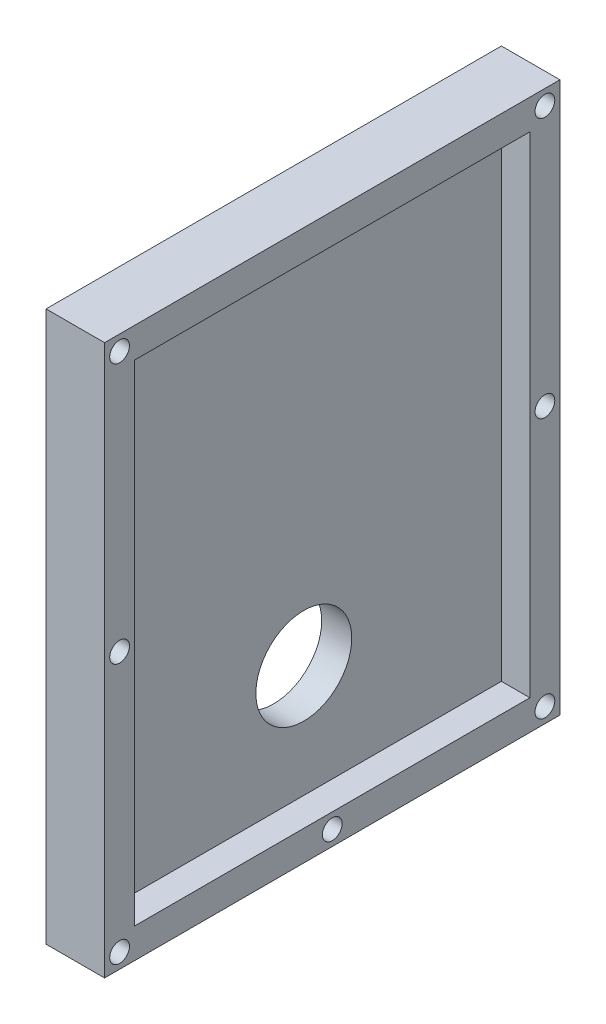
ISO-10303-21;
HEADER;
FILE_DESCRIPTION(('STEP AP214'),'2;1');
FILE_NAME('part.step','',(''),(''),'','','');
FILE_SCHEMA(('AUTOMOTIVE_DESIGN { 1 0 10303 214 1 1 1 1 }'));
ENDSEC;
DATA;
#1=APPLICATION_CONTEXT('core data for automotive mechanical design processes');
#2=APPLICATION_PROTOCOL_DEFINITION('international standard','automotive_design',2000,#1);
#3=PRODUCT_CONTEXT('',#1,'mechanical');
#4=PRODUCT('Part','Part','',(#3));
#5=PRODUCT_RELATED_PRODUCT_CATEGORY('part','',(#4));
#6=PRODUCT_DEFINITION_FORMATION('','',#4);
#7=PRODUCT_DEFINITION_CONTEXT('part definition',#1,'design');
#8=PRODUCT_DEFINITION('design','',#6,#7);
#9=PRODUCT_DEFINITION_SHAPE('','',#8);
#10=(LENGTH_UNIT() NAMED_UNIT(*) SI_UNIT(.MILLI.,.METRE.));
#11=(NAMED_UNIT(*) PLANE_ANGLE_UNIT() SI_UNIT($,.RADIAN.));
#12=(NAMED_UNIT(*) SI_UNIT($,.STERADIAN.) SOLID_ANGLE_UNIT());
#13=UNCERTAINTY_MEASURE_WITH_UNIT(LENGTH_MEASURE(1.E-05),#10,'distance_accuracy_value','');
#14=(GEOMETRIC_REPRESENTATION_CONTEXT(3) GLOBAL_UNCERTAINTY_ASSIGNED_CONTEXT((#13)) GLOBAL_UNIT_ASSIGNED_CONTEXT((#10,
#11,#12)) REPRESENTATION_CONTEXT('',''));
#15=CARTESIAN_POINT('',(0.,0.,0.));
#16=DIRECTION('',(0.,0.,1.));
#17=DIRECTION('',(1.,0.,0.));
#18=AXIS2_PLACEMENT_3D('',#15,#16,#17);
#19=CARTESIAN_POINT('',(2.286,0.,0.));
#20=DIRECTION('',(-1.,0.,0.));
#21=DIRECTION('',(0.,0.,1.));
#22=AXIS2_PLACEMENT_3D('',#19,#20,#21);
#23=PLANE('',#22);
#24=CARTESIAN_POINT('',(2.286,19.685,32.9565));
#25=DIRECTION('',(1.,0.,0.));
#26=DIRECTION('',(0.,0.,-1.));
#27=AXIS2_PLACEMENT_3D('',#24,#25,#26);
#28=CIRCLE('',#27,0.793749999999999);
#29=CARTESIAN_POINT('',(2.286,19.685,32.16275));
#30=VERTEX_POINT('',#29);
#31=EDGE_CURVE('E343',#30,#30,#28,.T.);
#32=ORIENTED_EDGE('',*,*,#31,.F.);
#33=EDGE_LOOP('',(#32));
#34=FACE_BOUND('',#33,.T.);
#35=CARTESIAN_POINT('',(2.286,40.5765,32.9565));
#36=DIRECTION('',(1.,0.,0.));
#37=DIRECTION('',(0.,0.,-1.));
#38=AXIS2_PLACEMENT_3D('',#35,#36,#37);
#39=CIRCLE('',#38,0.793749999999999);
#40=CARTESIAN_POINT('',(2.286,40.5765,32.16275));
#41=VERTEX_POINT('',#40);
#42=EDGE_CURVE('E349',#41,#41,#39,.T.);
#43=ORIENTED_EDGE('',*,*,#42,.F.);
#44=EDGE_LOOP('',(#43));
#45=FACE_BOUND('',#44,.T.);
#46=CARTESIAN_POINT('',(2.286,-1.2065,15.875));
#47=DIRECTION('',(1.,0.,0.));
#48=DIRECTION('',(0.,0.,-1.));
#49=AXIS2_PLACEMENT_3D('',#46,#47,#48);
#50=CIRCLE('',#49,0.793749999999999);
#51=CARTESIAN_POINT('',(2.286,-1.2065,15.08125));
#52=VERTEX_POINT('',#51);
#53=EDGE_CURVE('E360',#52,#52,#50,.T.);
#54=ORIENTED_EDGE('',*,*,#53,.F.);
#55=EDGE_LOOP('',(#54));
#56=FACE_BOUND('',#55,.T.);
#57=CARTESIAN_POINT('',(2.286,40.5765,-1.2065));
#58=DIRECTION('',(1.,0.,0.));
#59=DIRECTION('',(0.,0.,-1.));
#60=AXIS2_PLACEMENT_3D('',#57,#58,#59);
#61=CIRCLE('',#60,0.79375);
#62=CARTESIAN_POINT('',(2.286,40.5765,-2.00025));
#63=VERTEX_POINT('',#62);
#64=EDGE_CURVE('E366',#63,#63,#61,.T.);
#65=ORIENTED_EDGE('',*,*,#64,.F.);
#66=EDGE_LOOP('',(#65));
#67=FACE_BOUND('',#66,.T.);
#68=CARTESIAN_POINT('',(2.286,19.685,-1.2065));
#69=DIRECTION('',(1.,0.,0.));
#70=DIRECTION('',(0.,0.,-1.));
#71=AXIS2_PLACEMENT_3D('',#68,#69,#70);
#72=CIRCLE('',#71,0.79375);
#73=CARTESIAN_POINT('',(2.286,19.685,-2.00025));
#74=VERTEX_POINT('',#73);
#75=EDGE_CURVE('E372',#74,#74,#72,.T.);
#76=ORIENTED_EDGE('',*,*,#75,.F.);
#77=EDGE_LOOP('',(#76));
#78=FACE_BOUND('',#77,.T.);
#79=CARTESIAN_POINT('',(2.286,-1.2065,-1.2065));
#80=DIRECTION('',(1.,0.,0.));
#81=DIRECTION('',(0.,0.,-1.));
#82=AXIS2_PLACEMENT_3D('',#79,#80,#81);
#83=CIRCLE('',#82,0.79375);
#84=CARTESIAN_POINT('',(2.286,-1.2065,-2.00025));
#85=VERTEX_POINT('',#84);
#86=EDGE_CURVE('E397',#85,#85,#83,.T.);
#87=ORIENTED_EDGE('',*,*,#86,.F.);
#88=EDGE_LOOP('',(#87));
#89=FACE_BOUND('',#88,.T.);
#90=CARTESIAN_POINT('',(2.286,-1.2065,32.9565));
#91=DIRECTION('',(1.,0.,0.));
#92=DIRECTION('',(0.,0.,-1.));
#93=AXIS2_PLACEMENT_3D('',#90,#91,#92);
#94=CIRCLE('',#93,0.79375);
#95=CARTESIAN_POINT('',(2.286,-1.2065,32.16275));
#96=VERTEX_POINT('',#95);
#97=EDGE_CURVE('E344',#96,#96,#94,.T.);
#98=ORIENTED_EDGE('',*,*,#97,.F.);
#99=EDGE_LOOP('',(#98));
#100=FACE_BOUND('',#99,.T.);
#101=DIRECTION('',(0.,0.,-1.));
#102=VECTOR('',#101,1.);
#103=CARTESIAN_POINT('',(2.286,-2.413,0.));
#104=LINE('',#103,#102);
#105=CARTESIAN_POINT('',(2.286,-2.41300000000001,34.163));
#106=VERTEX_POINT('',#105);
#107=CARTESIAN_POINT('',(2.286,-2.413,-2.413));
#108=VERTEX_POINT('',#107);
#109=EDGE_CURVE('E168',#106,#108,#104,.T.);
#110=ORIENTED_EDGE('',*,*,#109,.T.);
#111=DIRECTION('',(0.,1.,0.));
#112=VECTOR('',#111,1.);
#113=CARTESIAN_POINT('',(2.286,0.,-2.413));
#114=LINE('',#113,#112);
#115=CARTESIAN_POINT('',(2.286,41.783,-2.413));
#116=VERTEX_POINT('',#115);
#117=EDGE_CURVE('E170',#108,#116,#114,.T.);
#118=ORIENTED_EDGE('',*,*,#117,.T.);
#119=DIRECTION('',(0.,0.,1.));
#120=VECTOR('',#119,1.);
#121=CARTESIAN_POINT('',(2.286,41.783,0.));
#122=LINE('',#121,#120);
#123=CARTESIAN_POINT('',(2.286,41.783,34.163));
#124=VERTEX_POINT('',#123);
#125=EDGE_CURVE('E171',#116,#124,#122,.T.);
#126=ORIENTED_EDGE('',*,*,#125,.T.);
#127=DIRECTION('',(0.,-1.,0.));
#128=VECTOR('',#127,1.);
#129=CARTESIAN_POINT('',(2.286,0.,34.163));
#130=LINE('',#129,#128);
#131=EDGE_CURVE('E47',#124,#106,#130,.T.);
#132=ORIENTED_EDGE('',*,*,#131,.T.);
#133=EDGE_LOOP('',(#110,#118,#126,#132));
#134=FACE_BOUND('',#133,.T.);
#135=DIRECTION('',(0.,0.,-1.));
#136=VECTOR('',#135,1.);
#137=CARTESIAN_POINT('',(2.286,0.,0.));
#138=LINE('',#137,#136);
#139=CARTESIAN_POINT('',(2.286,0.,31.75));
#140=VERTEX_POINT('',#139);
#141=CARTESIAN_POINT('',(2.286,0.,0.));
#142=VERTEX_POINT('',#141);
#143=EDGE_CURVE('E112',#140,#142,#138,.T.);
#144=ORIENTED_EDGE('',*,*,#143,.F.);
#145=DIRECTION('',(0.,-1.,0.));
#146=VECTOR('',#145,1.);
#147=CARTESIAN_POINT('',(2.286,0.,31.75));
#148=LINE('',#147,#146);
#149=CARTESIAN_POINT('',(2.286,39.37,31.75));
#150=VERTEX_POINT('',#149);
#151=EDGE_CURVE('E137',#150,#140,#148,.T.);
#152=ORIENTED_EDGE('',*,*,#151,.F.);
#153=DIRECTION('',(0.,0.,1.));
#154=VECTOR('',#153,1.);
#155=CARTESIAN_POINT('',(2.286,39.37,0.));
#156=LINE('',#155,#154);
#157=CARTESIAN_POINT('',(2.286,39.37,0.));
#158=VERTEX_POINT('',#157);
#159=EDGE_CURVE('E135',#158,#150,#156,.T.);
#160=ORIENTED_EDGE('',*,*,#159,.F.);
#161=DIRECTION('',(0.,1.,0.));
#162=VECTOR('',#161,1.);
#163=CARTESIAN_POINT('',(2.286,0.,0.));
#164=LINE('',#163,#162);
#165=EDGE_CURVE('E123',#142,#158,#164,.T.);
#166=ORIENTED_EDGE('',*,*,#165,.F.);
#167=EDGE_LOOP('',(#144,#152,#160,#166));
#168=FACE_BOUND('',#167,.T.);
#169=ADVANCED_FACE('F43',(#34,#45,#56,#67,#78,#89,#100,#134,#168),#23,.F.);
#170=CARTESIAN_POINT('',(2.286,-2.413,0.));
#171=DIRECTION('',(0.,1.,0.));
#172=DIRECTION('',(0.,0.,1.));
#173=AXIS2_PLACEMENT_3D('',#170,#171,#172);
#174=PLANE('',#173);
#175=DIRECTION('',(0.,0.,-1.));
#176=VECTOR('',#175,1.);
#177=CARTESIAN_POINT('',(-2.413,-2.413,0.));
#178=LINE('',#177,#176);
#179=CARTESIAN_POINT('',(-2.413,-2.41300000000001,34.163));
#180=VERTEX_POINT('',#179);
#181=CARTESIAN_POINT('',(-2.413,-2.413,-2.413));
#182=VERTEX_POINT('',#181);
#183=EDGE_CURVE('E131',#180,#182,#178,.T.);
#184=ORIENTED_EDGE('',*,*,#183,.T.);
#185=DIRECTION('',(-1.,0.,0.));
#186=VECTOR('',#185,1.);
#187=CARTESIAN_POINT('',(2.286,-2.413,-2.413));
#188=LINE('',#187,#186);
#189=EDGE_CURVE('E11',#108,#182,#188,.T.);
#190=ORIENTED_EDGE('',*,*,#189,.F.);
#191=ORIENTED_EDGE('',*,*,#109,.F.);
#192=DIRECTION('',(-1.,0.,0.));
#193=VECTOR('',#192,1.);
#194=CARTESIAN_POINT('',(2.286,-2.41300000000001,34.163));
#195=LINE('',#194,#193);
#196=EDGE_CURVE('E155',#106,#180,#195,.T.);
#197=ORIENTED_EDGE('',*,*,#196,.T.);
#198=EDGE_LOOP('',(#184,#190,#191,#197));
#199=FACE_BOUND('',#198,.T.);
#200=ADVANCED_FACE('F185',(#199),#174,.F.);
#201=CARTESIAN_POINT('',(2.286,0.,-2.413));
#202=DIRECTION('',(0.,0.,1.));
#203=DIRECTION('',(1.,0.,0.));
#204=AXIS2_PLACEMENT_3D('',#201,#202,#203);
#205=PLANE('',#204);
#206=DIRECTION('',(0.,1.,0.));
#207=VECTOR('',#206,1.);
#208=CARTESIAN_POINT('',(-2.413,0.,-2.413));
#209=LINE('',#208,#207);
#210=CARTESIAN_POINT('',(-2.413,41.783,-2.413));
#211=VERTEX_POINT('',#210);
#212=EDGE_CURVE('E153',#182,#211,#209,.T.);
#213=ORIENTED_EDGE('',*,*,#212,.T.);
#214=DIRECTION('',(-1.,0.,0.));
#215=VECTOR('',#214,1.);
#216=CARTESIAN_POINT('',(2.286,41.783,-2.413));
#217=LINE('',#216,#215);
#218=EDGE_CURVE('E52',#116,#211,#217,.T.);
#219=ORIENTED_EDGE('',*,*,#218,.F.);
#220=ORIENTED_EDGE('',*,*,#117,.F.);
#221=ORIENTED_EDGE('',*,*,#189,.T.);
#222=EDGE_LOOP('',(#213,#219,#220,#221));
#223=FACE_BOUND('',#222,.T.);
#224=ADVANCED_FACE('F187',(#223),#205,.F.);
#225=CARTESIAN_POINT('',(2.286,41.783,0.));
#226=DIRECTION('',(0.,-1.,0.));
#227=DIRECTION('',(0.,0.,-1.));
#228=AXIS2_PLACEMENT_3D('',#225,#226,#227);
#229=PLANE('',#228);
#230=DIRECTION('',(0.,0.,1.));
#231=VECTOR('',#230,1.);
#232=CARTESIAN_POINT('',(-2.413,41.783,0.));
#233=LINE('',#232,#231);
#234=CARTESIAN_POINT('',(-2.413,41.783,34.163));
#235=VERTEX_POINT('',#234);
#236=EDGE_CURVE('E160',#211,#235,#233,.T.);
#237=ORIENTED_EDGE('',*,*,#236,.T.);
#238=DIRECTION('',(-1.,0.,0.));
#239=VECTOR('',#238,1.);
#240=CARTESIAN_POINT('',(2.286,41.783,34.163));
#241=LINE('',#240,#239);
#242=EDGE_CURVE('E158',#124,#235,#241,.T.);
#243=ORIENTED_EDGE('',*,*,#242,.F.);
#244=ORIENTED_EDGE('',*,*,#125,.F.);
#245=ORIENTED_EDGE('',*,*,#218,.T.);
#246=EDGE_LOOP('',(#237,#243,#244,#245));
#247=FACE_BOUND('',#246,.T.);
#248=ADVANCED_FACE('F176',(#247),#229,.F.);
#249=CARTESIAN_POINT('',(2.286,0.,34.163));
#250=DIRECTION('',(0.,0.,-1.));
#251=DIRECTION('',(-1.,0.,0.));
#252=AXIS2_PLACEMENT_3D('',#249,#250,#251);
#253=PLANE('',#252);
#254=DIRECTION('',(0.,-1.,0.));
#255=VECTOR('',#254,1.);
#256=CARTESIAN_POINT('',(-2.413,0.,34.163));
#257=LINE('',#256,#255);
#258=EDGE_CURVE('E164',#235,#180,#257,.T.);
#259=ORIENTED_EDGE('',*,*,#258,.T.);
#260=ORIENTED_EDGE('',*,*,#196,.F.);
#261=ORIENTED_EDGE('',*,*,#131,.F.);
#262=ORIENTED_EDGE('',*,*,#242,.T.);
#263=EDGE_LOOP('',(#259,#260,#261,#262));
#264=FACE_BOUND('',#263,.T.);
#265=ADVANCED_FACE('F180',(#264),#253,.F.);
#266=CARTESIAN_POINT('',(-2.413,0.,0.));
#267=DIRECTION('',(-1.,0.,0.));
#268=DIRECTION('',(0.,0.,1.));
#269=AXIS2_PLACEMENT_3D('',#266,#267,#268);
#270=PLANE('',#269);
#271=CARTESIAN_POINT('',(-2.413,19.685,32.9565));
#272=DIRECTION('',(1.,0.,0.));
#273=DIRECTION('',(0.,0.,-1.));
#274=AXIS2_PLACEMENT_3D('',#271,#272,#273);
#275=CIRCLE('',#274,0.793749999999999);
#276=CARTESIAN_POINT('',(-2.413,19.685,32.16275));
#277=VERTEX_POINT('',#276);
#278=EDGE_CURVE('E341',#277,#277,#275,.T.);
#279=ORIENTED_EDGE('',*,*,#278,.T.);
#280=EDGE_LOOP('',(#279));
#281=FACE_BOUND('',#280,.T.);
#282=CARTESIAN_POINT('',(-2.413,40.5765,32.9565));
#283=DIRECTION('',(1.,0.,0.));
#284=DIRECTION('',(0.,0.,-1.));
#285=AXIS2_PLACEMENT_3D('',#282,#283,#284);
#286=CIRCLE('',#285,0.793749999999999);
#287=CARTESIAN_POINT('',(-2.413,40.5765,32.16275));
#288=VERTEX_POINT('',#287);
#289=EDGE_CURVE('E357',#288,#288,#286,.T.);
#290=ORIENTED_EDGE('',*,*,#289,.T.);
#291=EDGE_LOOP('',(#290));
#292=FACE_BOUND('',#291,.T.);
#293=CARTESIAN_POINT('',(-2.413,-1.2065,15.875));
#294=DIRECTION('',(1.,0.,0.));
#295=DIRECTION('',(0.,0.,-1.));
#296=AXIS2_PLACEMENT_3D('',#293,#294,#295);
#297=CIRCLE('',#296,0.793749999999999);
#298=CARTESIAN_POINT('',(-2.413,-1.2065,15.08125));
#299=VERTEX_POINT('',#298);
#300=EDGE_CURVE('E363',#299,#299,#297,.T.);
#301=ORIENTED_EDGE('',*,*,#300,.T.);
#302=EDGE_LOOP('',(#301));
#303=FACE_BOUND('',#302,.T.);
#304=CARTESIAN_POINT('',(-2.413,40.5765,-1.2065));
#305=DIRECTION('',(1.,0.,0.));
#306=DIRECTION('',(0.,0.,-1.));
#307=AXIS2_PLACEMENT_3D('',#304,#305,#306);
#308=CIRCLE('',#307,0.79375);
#309=CARTESIAN_POINT('',(-2.413,40.5765,-2.00025));
#310=VERTEX_POINT('',#309);
#311=EDGE_CURVE('E369',#310,#310,#308,.T.);
#312=ORIENTED_EDGE('',*,*,#311,.T.);
#313=EDGE_LOOP('',(#312));
#314=FACE_BOUND('',#313,.T.);
#315=CARTESIAN_POINT('',(-2.413,19.685,-1.2065));
#316=DIRECTION('',(1.,0.,0.));
#317=DIRECTION('',(0.,0.,-1.));
#318=AXIS2_PLACEMENT_3D('',#315,#316,#317);
#319=CIRCLE('',#318,0.79375);
#320=CARTESIAN_POINT('',(-2.413,19.685,-2.00025));
#321=VERTEX_POINT('',#320);
#322=EDGE_CURVE('E392',#321,#321,#319,.T.);
#323=ORIENTED_EDGE('',*,*,#322,.T.);
#324=EDGE_LOOP('',(#323));
#325=FACE_BOUND('',#324,.T.);
#326=CARTESIAN_POINT('',(-2.413,-1.2065,-1.2065));
#327=DIRECTION('',(1.,0.,0.));
#328=DIRECTION('',(0.,0.,-1.));
#329=AXIS2_PLACEMENT_3D('',#326,#327,#328);
#330=CIRCLE('',#329,0.79375);
#331=CARTESIAN_POINT('',(-2.413,-1.2065,-2.00025));
#332=VERTEX_POINT('',#331);
#333=EDGE_CURVE('E352',#332,#332,#330,.T.);
#334=ORIENTED_EDGE('',*,*,#333,.T.);
#335=EDGE_LOOP('',(#334));
#336=FACE_BOUND('',#335,.T.);
#337=CARTESIAN_POINT('',(-2.413,-1.2065,32.9565));
#338=DIRECTION('',(1.,0.,0.));
#339=DIRECTION('',(0.,0.,-1.));
#340=AXIS2_PLACEMENT_3D('',#337,#338,#339);
#341=CIRCLE('',#340,0.79375);
#342=CARTESIAN_POINT('',(-2.413,-1.2065,32.16275));
#343=VERTEX_POINT('',#342);
#344=EDGE_CURVE('E347',#343,#343,#341,.T.);
#345=ORIENTED_EDGE('',*,*,#344,.T.);
#346=EDGE_LOOP('',(#345));
#347=FACE_BOUND('',#346,.T.);
#348=CARTESIAN_POINT('',(-2.413,9.01699999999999,15.875));
#349=DIRECTION('',(1.,0.,0.));
#350=DIRECTION('',(0.,0.,-1.));
#351=AXIS2_PLACEMENT_3D('',#348,#349,#350);
#352=CIRCLE('',#351,3.85091664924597);
#353=CARTESIAN_POINT('',(-2.413,9.01699999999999,12.024083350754));
#354=VERTEX_POINT('',#353);
#355=EDGE_CURVE('E144',#354,#354,#352,.T.);
#356=ORIENTED_EDGE('',*,*,#355,.T.);
#357=EDGE_LOOP('',(#356));
#358=FACE_BOUND('',#357,.T.);
#359=ORIENTED_EDGE('',*,*,#183,.F.);
#360=ORIENTED_EDGE('',*,*,#258,.F.);
#361=ORIENTED_EDGE('',*,*,#236,.F.);
#362=ORIENTED_EDGE('',*,*,#212,.F.);
#363=EDGE_LOOP('',(#359,#360,#361,#362));
#364=FACE_BOUND('',#363,.T.);
#365=ADVANCED_FACE('F45',(#281,#292,#303,#314,#325,#336,#347,#358,#364),#270,.T.);
#366=CARTESIAN_POINT('',(2.286,0.,0.));
#367=DIRECTION('',(0.,1.,0.));
#368=DIRECTION('',(0.,0.,1.));
#369=AXIS2_PLACEMENT_3D('',#366,#367,#368);
#370=PLANE('',#369);
#371=DIRECTION('',(0.,0.,-1.));
#372=VECTOR('',#371,1.);
#373=CARTESIAN_POINT('',(0.,0.,0.));
#374=LINE('',#373,#372);
#375=CARTESIAN_POINT('',(0.,0.,31.75));
#376=VERTEX_POINT('',#375);
#377=CARTESIAN_POINT('',(0.,0.,0.));
#378=VERTEX_POINT('',#377);
#379=EDGE_CURVE('E142',#376,#378,#374,.T.);
#380=ORIENTED_EDGE('',*,*,#379,.F.);
#381=DIRECTION('',(-1.,0.,0.));
#382=VECTOR('',#381,1.);
#383=CARTESIAN_POINT('',(2.286,0.,31.75));
#384=LINE('',#383,#382);
#385=EDGE_CURVE('E119',#140,#376,#384,.T.);
#386=ORIENTED_EDGE('',*,*,#385,.F.);
#387=ORIENTED_EDGE('',*,*,#143,.T.);
#388=DIRECTION('',(-1.,0.,0.));
#389=VECTOR('',#388,1.);
#390=CARTESIAN_POINT('',(2.286,0.,0.));
#391=LINE('',#390,#389);
#392=EDGE_CURVE('E116',#142,#378,#391,.T.);
#393=ORIENTED_EDGE('',*,*,#392,.T.);
#394=EDGE_LOOP('',(#380,#386,#387,#393));
#395=FACE_BOUND('',#394,.T.);
#396=ADVANCED_FACE('F115',(#395),#370,.T.);
#397=CARTESIAN_POINT('',(2.286,0.,0.));
#398=DIRECTION('',(0.,0.,1.));
#399=DIRECTION('',(1.,0.,0.));
#400=AXIS2_PLACEMENT_3D('',#397,#398,#399);
#401=PLANE('',#400);
#402=DIRECTION('',(0.,1.,0.));
#403=VECTOR('',#402,1.);
#404=CARTESIAN_POINT('',(0.,0.,0.));
#405=LINE('',#404,#403);
#406=CARTESIAN_POINT('',(0.,39.37,0.));
#407=VERTEX_POINT('',#406);
#408=EDGE_CURVE('E130',#378,#407,#405,.T.);
#409=ORIENTED_EDGE('',*,*,#408,.F.);
#410=ORIENTED_EDGE('',*,*,#392,.F.);
#411=ORIENTED_EDGE('',*,*,#165,.T.);
#412=DIRECTION('',(-1.,0.,0.));
#413=VECTOR('',#412,1.);
#414=CARTESIAN_POINT('',(2.286,39.37,0.));
#415=LINE('',#414,#413);
#416=EDGE_CURVE('E132',#158,#407,#415,.T.);
#417=ORIENTED_EDGE('',*,*,#416,.T.);
#418=EDGE_LOOP('',(#409,#410,#411,#417));
#419=FACE_BOUND('',#418,.T.);
#420=ADVANCED_FACE('F127',(#419),#401,.T.);
#421=CARTESIAN_POINT('',(2.286,39.37,0.));
#422=DIRECTION('',(0.,-1.,0.));
#423=DIRECTION('',(0.,0.,-1.));
#424=AXIS2_PLACEMENT_3D('',#421,#422,#423);
#425=PLANE('',#424);
#426=DIRECTION('',(0.,0.,1.));
#427=VECTOR('',#426,1.);
#428=CARTESIAN_POINT('',(0.,39.37,0.));
#429=LINE('',#428,#427);
#430=CARTESIAN_POINT('',(0.,39.37,31.75));
#431=VERTEX_POINT('',#430);
#432=EDGE_CURVE('E146',#407,#431,#429,.T.);
#433=ORIENTED_EDGE('',*,*,#432,.F.);
#434=ORIENTED_EDGE('',*,*,#416,.F.);
#435=ORIENTED_EDGE('',*,*,#159,.T.);
#436=DIRECTION('',(-1.,0.,0.));
#437=VECTOR('',#436,1.);
#438=CARTESIAN_POINT('',(2.286,39.37,31.75));
#439=LINE('',#438,#437);
#440=EDGE_CURVE('E60',#150,#431,#439,.T.);
#441=ORIENTED_EDGE('',*,*,#440,.T.);
#442=EDGE_LOOP('',(#433,#434,#435,#441));
#443=FACE_BOUND('',#442,.T.);
#444=ADVANCED_FACE('F234',(#443),#425,.T.);
#445=CARTESIAN_POINT('',(2.286,0.,31.75));
#446=DIRECTION('',(0.,0.,-1.));
#447=DIRECTION('',(-1.,0.,0.));
#448=AXIS2_PLACEMENT_3D('',#445,#446,#447);
#449=PLANE('',#448);
#450=DIRECTION('',(0.,-1.,0.));
#451=VECTOR('',#450,1.);
#452=CARTESIAN_POINT('',(0.,0.,31.75));
#453=LINE('',#452,#451);
#454=EDGE_CURVE('E124',#431,#376,#453,.T.);
#455=ORIENTED_EDGE('',*,*,#454,.F.);
#456=ORIENTED_EDGE('',*,*,#440,.F.);
#457=ORIENTED_EDGE('',*,*,#151,.T.);
#458=ORIENTED_EDGE('',*,*,#385,.T.);
#459=EDGE_LOOP('',(#455,#456,#457,#458));
#460=FACE_BOUND('',#459,.T.);
#461=ADVANCED_FACE('F240',(#460),#449,.T.);
#462=CARTESIAN_POINT('',(0.,0.,0.));
#463=DIRECTION('',(-1.,0.,0.));
#464=DIRECTION('',(0.,0.,1.));
#465=AXIS2_PLACEMENT_3D('',#462,#463,#464);
#466=PLANE('',#465);
#467=CARTESIAN_POINT('',(0.,9.01699999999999,15.875));
#468=DIRECTION('',(1.,0.,0.));
#469=DIRECTION('',(0.,0.,-1.));
#470=AXIS2_PLACEMENT_3D('',#467,#468,#469);
#471=CIRCLE('',#470,3.85091664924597);
#472=CARTESIAN_POINT('',(0.,9.01699999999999,12.024083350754));
#473=VERTEX_POINT('',#472);
#474=EDGE_CURVE('E374',#473,#473,#471,.T.);
#475=ORIENTED_EDGE('',*,*,#474,.F.);
#476=EDGE_LOOP('',(#475));
#477=FACE_BOUND('',#476,.T.);
#478=ORIENTED_EDGE('',*,*,#379,.T.);
#479=ORIENTED_EDGE('',*,*,#408,.T.);
#480=ORIENTED_EDGE('',*,*,#432,.T.);
#481=ORIENTED_EDGE('',*,*,#454,.T.);
#482=EDGE_LOOP('',(#478,#479,#480,#481));
#483=FACE_BOUND('',#482,.T.);
#484=ADVANCED_FACE('F248',(#477,#483),#466,.F.);
#485=CARTESIAN_POINT('',(-2.413,9.01699999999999,15.875));
#486=DIRECTION('',(1.,0.,0.));
#487=DIRECTION('',(0.,0.,-1.));
#488=AXIS2_PLACEMENT_3D('',#485,#486,#487);
#489=CYLINDRICAL_SURFACE('',#488,3.85091664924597);
#490=ORIENTED_EDGE('',*,*,#355,.F.);
#491=EDGE_LOOP('',(#490));
#492=FACE_BOUND('',#491,.T.);
#493=ORIENTED_EDGE('',*,*,#474,.T.);
#494=EDGE_LOOP('',(#493));
#495=FACE_BOUND('',#494,.T.);
#496=ADVANCED_FACE('F254',(#492,#495),#489,.F.);
#497=CARTESIAN_POINT('',(-2.413,-1.2065,32.9565));
#498=DIRECTION('',(1.,0.,0.));
#499=DIRECTION('',(0.,0.,-1.));
#500=AXIS2_PLACEMENT_3D('',#497,#498,#499);
#501=CYLINDRICAL_SURFACE('',#500,0.79375);
#502=ORIENTED_EDGE('',*,*,#344,.F.);
#503=EDGE_LOOP('',(#502));
#504=FACE_BOUND('',#503,.T.);
#505=ORIENTED_EDGE('',*,*,#97,.T.);
#506=EDGE_LOOP('',(#505));
#507=FACE_BOUND('',#506,.T.);
#508=ADVANCED_FACE('F262',(#504,#507),#501,.F.);
#509=CARTESIAN_POINT('',(-2.413,-1.2065,-1.2065));
#510=DIRECTION('',(1.,0.,0.));
#511=DIRECTION('',(0.,0.,-1.));
#512=AXIS2_PLACEMENT_3D('',#509,#510,#511);
#513=CYLINDRICAL_SURFACE('',#512,0.79375);
#514=ORIENTED_EDGE('',*,*,#333,.F.);
#515=EDGE_LOOP('',(#514));
#516=FACE_BOUND('',#515,.T.);
#517=ORIENTED_EDGE('',*,*,#86,.T.);
#518=EDGE_LOOP('',(#517));
#519=FACE_BOUND('',#518,.T.);
#520=ADVANCED_FACE('F276',(#516,#519),#513,.F.);
#521=CARTESIAN_POINT('',(-2.413,19.685,-1.2065));
#522=DIRECTION('',(1.,0.,0.));
#523=DIRECTION('',(0.,0.,-1.));
#524=AXIS2_PLACEMENT_3D('',#521,#522,#523);
#525=CYLINDRICAL_SURFACE('',#524,0.79375);
#526=ORIENTED_EDGE('',*,*,#322,.F.);
#527=EDGE_LOOP('',(#526));
#528=FACE_BOUND('',#527,.T.);
#529=ORIENTED_EDGE('',*,*,#75,.T.);
#530=EDGE_LOOP('',(#529));
#531=FACE_BOUND('',#530,.T.);
#532=ADVANCED_FACE('F286',(#528,#531),#525,.F.);
#533=CARTESIAN_POINT('',(-2.413,40.5765,-1.2065));
#534=DIRECTION('',(1.,0.,0.));
#535=DIRECTION('',(0.,0.,-1.));
#536=AXIS2_PLACEMENT_3D('',#533,#534,#535);
#537=CYLINDRICAL_SURFACE('',#536,0.79375);
#538=ORIENTED_EDGE('',*,*,#311,.F.);
#539=EDGE_LOOP('',(#538));
#540=FACE_BOUND('',#539,.T.);
#541=ORIENTED_EDGE('',*,*,#64,.T.);
#542=EDGE_LOOP('',(#541));
#543=FACE_BOUND('',#542,.T.);
#544=ADVANCED_FACE('F296',(#540,#543),#537,.F.);
#545=CARTESIAN_POINT('',(-2.413,-1.2065,15.875));
#546=DIRECTION('',(1.,0.,0.));
#547=DIRECTION('',(0.,0.,-1.));
#548=AXIS2_PLACEMENT_3D('',#545,#546,#547);
#549=CYLINDRICAL_SURFACE('',#548,0.793749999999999);
#550=ORIENTED_EDGE('',*,*,#300,.F.);
#551=EDGE_LOOP('',(#550));
#552=FACE_BOUND('',#551,.T.);
#553=ORIENTED_EDGE('',*,*,#53,.T.);
#554=EDGE_LOOP('',(#553));
#555=FACE_BOUND('',#554,.T.);
#556=ADVANCED_FACE('F306',(#552,#555),#549,.F.);
#557=CARTESIAN_POINT('',(-2.413,40.5765,32.9565));
#558=DIRECTION('',(1.,0.,0.));
#559=DIRECTION('',(0.,0.,-1.));
#560=AXIS2_PLACEMENT_3D('',#557,#558,#559);
#561=CYLINDRICAL_SURFACE('',#560,0.793749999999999);
#562=ORIENTED_EDGE('',*,*,#289,.F.);
#563=EDGE_LOOP('',(#562));
#564=FACE_BOUND('',#563,.T.);
#565=ORIENTED_EDGE('',*,*,#42,.T.);
#566=EDGE_LOOP('',(#565));
#567=FACE_BOUND('',#566,.T.);
#568=ADVANCED_FACE('F316',(#564,#567),#561,.F.);
#569=CARTESIAN_POINT('',(-2.413,19.685,32.9565));
#570=DIRECTION('',(1.,0.,0.));
#571=DIRECTION('',(0.,0.,-1.));
#572=AXIS2_PLACEMENT_3D('',#569,#570,#571);
#573=CYLINDRICAL_SURFACE('',#572,0.793749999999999);
#574=ORIENTED_EDGE('',*,*,#278,.F.);
#575=EDGE_LOOP('',(#574));
#576=FACE_BOUND('',#575,.T.);
#577=ORIENTED_EDGE('',*,*,#31,.T.);
#578=EDGE_LOOP('',(#577));
#579=FACE_BOUND('',#578,.T.);
#580=ADVANCED_FACE('F326',(#576,#579),#573,.F.);
#581=CLOSED_SHELL('',(#169,#200,#224,#248,#265,#365,#396,#420,#444,#461,#484,#496,#508,#520,
#532,#544,#556,#568,#580));
#582=MANIFOLD_SOLID_BREP('B2',#581);
#583=ADVANCED_BREP_SHAPE_REPRESENTATION('',(#18,#582),#14);
#584=SHAPE_DEFINITION_REPRESENTATION(#9,#583);
ENDSEC;
END-ISO-10303-21;
